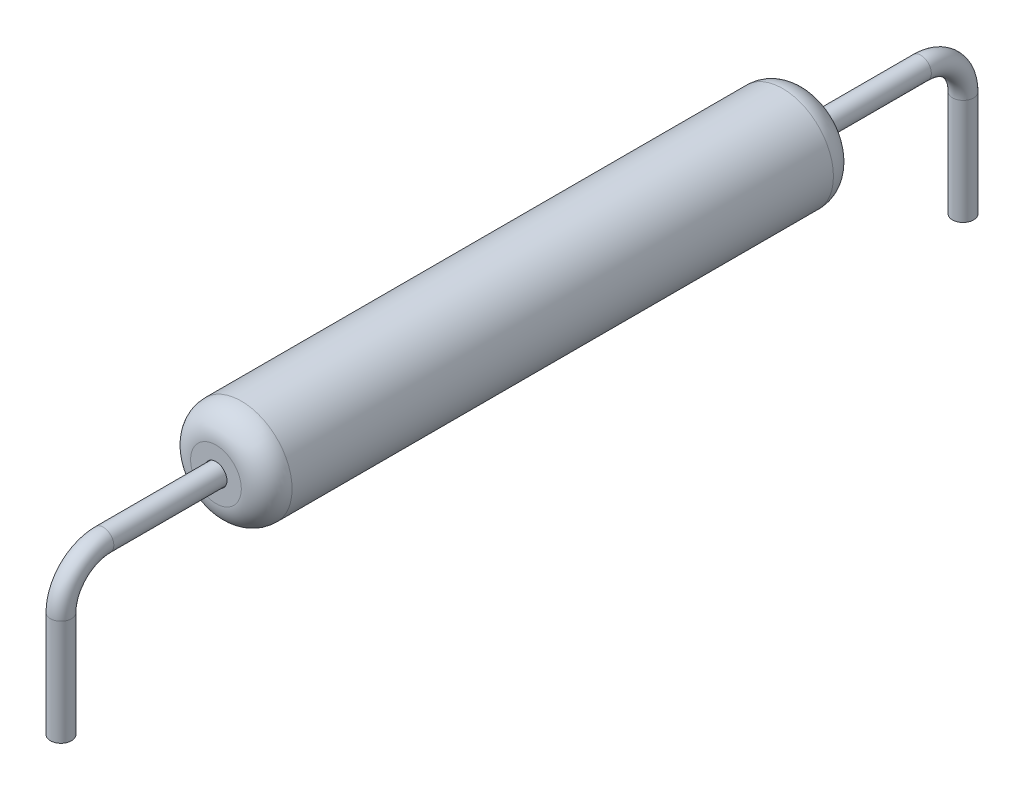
from build123d import *

# Parameters (mm, degrees)
ESQUISSE1_R      = 1.2
ESQUISSE1_R_2    = 0.26
EXTRUSION1_DEPTH = 14
ESQUISSE3_R      = 0.25
CONG_1_R         = 0.6


with BuildPart() as part:
    # Esquisse1 → Extrusion1 (new body)
    with BuildSketch(Plane.XY):
        Circle(ESQUISSE1_R)
        Circle(ESQUISSE1_R_2, mode=Mode.SUBTRACT)
    extrude(amount=EXTRUSION1_DEPTH)

    # Cong_1
    cong_1_edges = [part.edges().sort_by_distance(p)[0] for p in [
        (-1.2, 0, 0),
        (-1.2, 0, 14),
    ]]
    fillet(cong_1_edges, radius=CONG_1_R)


with BuildPart() as body_2:
    # Balayage1: sweep along a path in Esquisse2
    with BuildLine(Plane(origin=(0, 0, 0), x_dir=(0, 0, -1), z_dir=(1, 0, 0))) as balayage1_path:
        Line((-7, 0), (-16.665, 0))
        ThreePointArc((-16.665, 0), (-17.372106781, -0.292893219), (-17.665, -1))
        Line((-17.665, -1), (-17.665, -3.5))
    # Esquisse3 → Balayage1 (sweep)
    with BuildSketch(Plane.XY.offset(7)):
        Circle(ESQUISSE3_R)
    balayage1 = sweep(path=balayage1_path.line)

    # Sym_trie1: Balayage1 across plane
    add(balayage1.mirror(Plane.XY.offset(7)))


solid = Compound([part.part, body_2.part])
